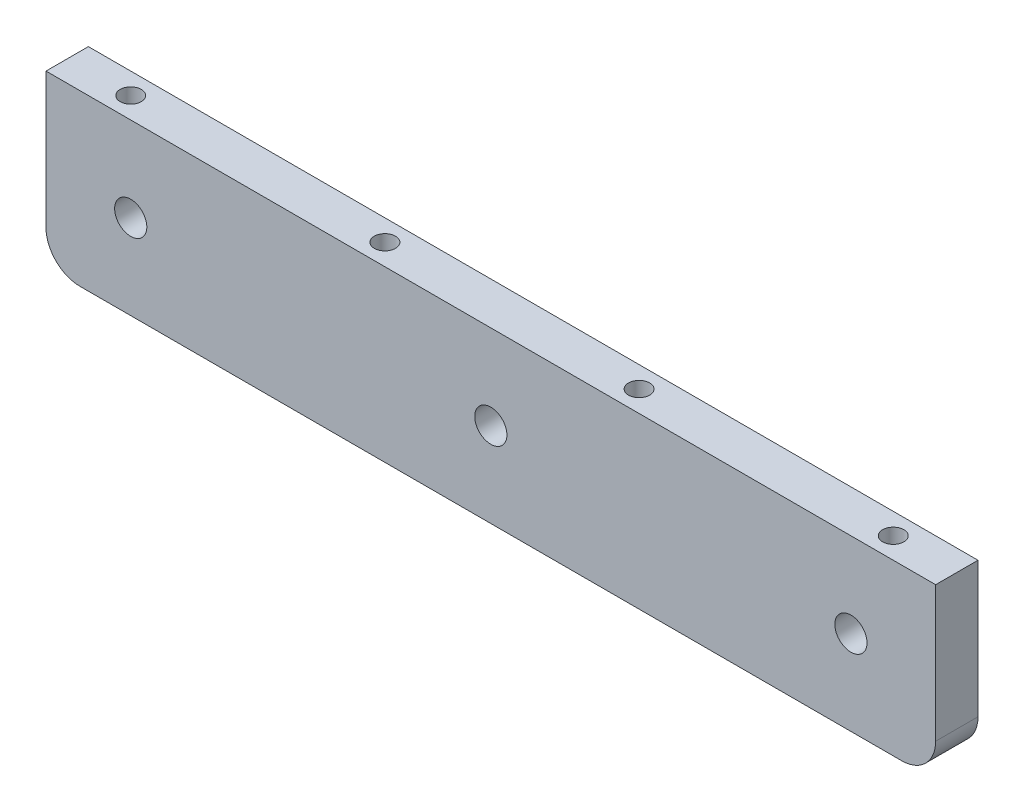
from build123d import *

# Parameters (mm, degrees)
SKETCH1_R           = 4.826
BOSS_EXTRUDE1_DEPTH = 6.35
SKETCH2_R           = 3.175
CUT_EXTRUDE1_DEPTH  = 19.05


with BuildPart() as part:
    # Sketch1 → Boss-Extrude1 (new, symmetric)
    with BuildSketch(Plane.XY):
        with BuildLine():
            Line((133.35, 0), (-133.35, 0))
            Line((-133.35, 0), (-133.35, -40.64))
            ThreePointArc((-133.35, -40.64), (-130.374204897, -47.824204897), (-123.19, -50.8))
            Line((-123.19, -50.8), (123.19, -50.8))
            ThreePointArc((123.19, -50.8), (130.374204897, -47.824204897), (133.35, -40.64))
            Line((133.35, -40.64), (133.35, 0))
        make_face()
        with Locations((-107.95, -25.4)):
            Circle(SKETCH1_R, mode=Mode.SUBTRACT)
        with Locations((0, -25.4)):
            Circle(SKETCH1_R, mode=Mode.SUBTRACT)
        with Locations((107.95, -25.4)):
            Circle(SKETCH1_R, mode=Mode.SUBTRACT)
    extrude(amount=BOSS_EXTRUDE1_DEPTH, both=True)

    # Sketch2 → Cut-Extrude1 (cut)
    with BuildSketch(Plane(origin=(0, 0, 0), x_dir=(1, 0, 0), z_dir=(0, 1, 0))):
        with Locations(Location((114.3, 0, 0), (0, 0, 270))):
            Circle(SKETCH2_R)
        with Locations(Location((38.1, 0, 0), (0, 0, 270))):
            Circle(SKETCH2_R)
        with Locations(Location((-38.1, 0, 0), (0, 0, 270))):
            Circle(SKETCH2_R)
        with Locations(Location((-114.3, 0, 0), (0, 0, 270))):
            Circle(SKETCH2_R)
    extrude(amount=-CUT_EXTRUDE1_DEPTH, mode=Mode.SUBTRACT)


solid = part.part
